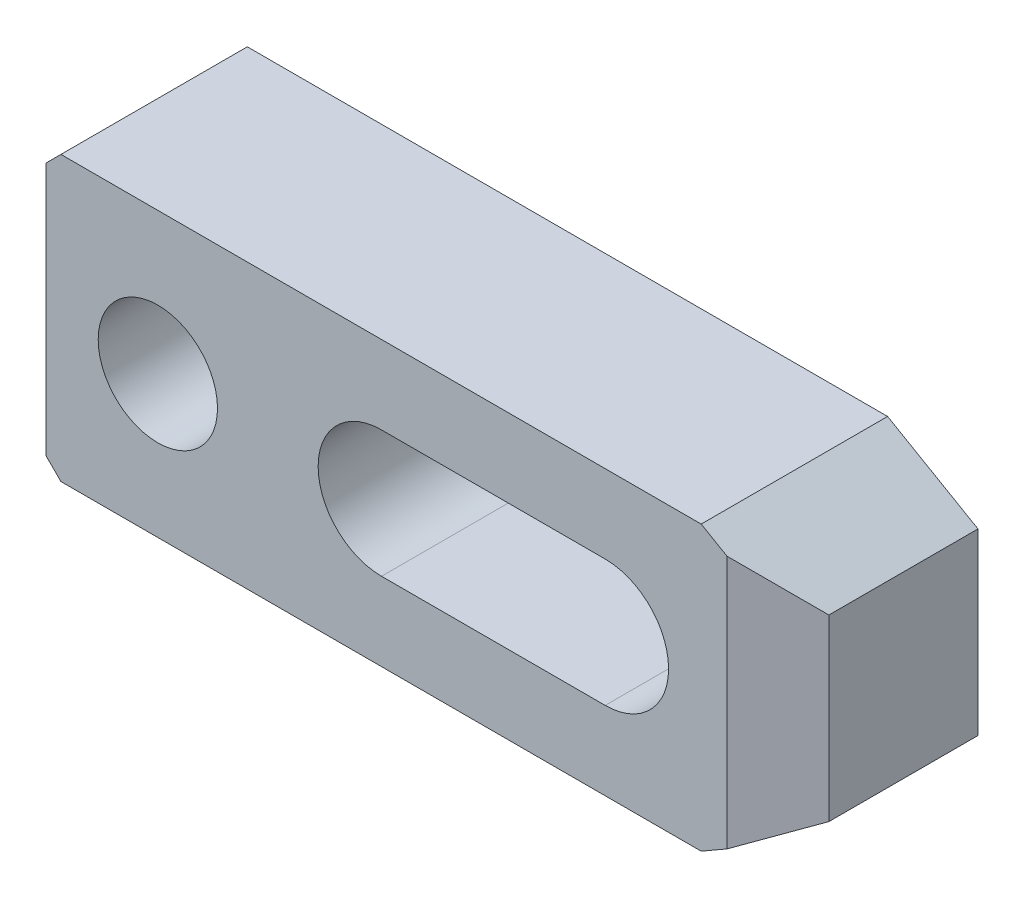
ISO-10303-21;
HEADER;
FILE_DESCRIPTION(('STEP AP214'),'2;1');
FILE_NAME('part.step','',(''),(''),'','','');
FILE_SCHEMA(('AUTOMOTIVE_DESIGN { 1 0 10303 214 1 1 1 1 }'));
ENDSEC;
DATA;
#1=APPLICATION_CONTEXT('core data for automotive mechanical design processes');
#2=APPLICATION_PROTOCOL_DEFINITION('international standard','automotive_design',2000,#1);
#3=PRODUCT_CONTEXT('',#1,'mechanical');
#4=PRODUCT('Part','Part','',(#3));
#5=PRODUCT_RELATED_PRODUCT_CATEGORY('part','',(#4));
#6=PRODUCT_DEFINITION_FORMATION('','',#4);
#7=PRODUCT_DEFINITION_CONTEXT('part definition',#1,'design');
#8=PRODUCT_DEFINITION('design','',#6,#7);
#9=PRODUCT_DEFINITION_SHAPE('','',#8);
#10=(LENGTH_UNIT() NAMED_UNIT(*) SI_UNIT(.MILLI.,.METRE.));
#11=(NAMED_UNIT(*) PLANE_ANGLE_UNIT() SI_UNIT($,.RADIAN.));
#12=(NAMED_UNIT(*) SI_UNIT($,.STERADIAN.) SOLID_ANGLE_UNIT());
#13=UNCERTAINTY_MEASURE_WITH_UNIT(LENGTH_MEASURE(1.E-05),#10,'distance_accuracy_value','');
#14=(GEOMETRIC_REPRESENTATION_CONTEXT(3) GLOBAL_UNCERTAINTY_ASSIGNED_CONTEXT((#13)) GLOBAL_UNIT_ASSIGNED_CONTEXT((#10,
#11,#12)) REPRESENTATION_CONTEXT('',''));
#15=CARTESIAN_POINT('',(0.,0.,0.));
#16=DIRECTION('',(0.,0.,1.));
#17=DIRECTION('',(1.,0.,0.));
#18=AXIS2_PLACEMENT_3D('',#15,#16,#17);
#19=CARTESIAN_POINT('',(-41.5673326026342,50.4326673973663,0.));
#20=DIRECTION('',(0.,0.,1.));
#21=DIRECTION('',(-1.,0.,0.));
#22=AXIS2_PLACEMENT_3D('',#19,#20,#21);
#23=PLANE('',#22);
#24=DIRECTION('',(0.,1.,0.));
#25=VECTOR('',#24,1.);
#26=CARTESIAN_POINT('',(-75.,-17.0000000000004,0.));
#27=LINE('',#26,#25);
#28=CARTESIAN_POINT('',(-75.,-17.0000000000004,0.));
#29=VERTEX_POINT('',#28);
#30=CARTESIAN_POINT('',(-75.,-8.50000000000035,0.));
#31=VERTEX_POINT('',#30);
#32=EDGE_CURVE('E147',#29,#31,#27,.T.);
#33=ORIENTED_EDGE('',*,*,#32,.T.);
#34=DIRECTION('',(-1.,0.,0.));
#35=VECTOR('',#34,1.);
#36=CARTESIAN_POINT('',(0.,-8.49999999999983,0.));
#37=LINE('',#36,#35);
#38=CARTESIAN_POINT('',(0.,-8.49999999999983,0.));
#39=VERTEX_POINT('',#38);
#40=EDGE_CURVE('E237',#39,#31,#37,.T.);
#41=ORIENTED_EDGE('',*,*,#40,.F.);
#42=CARTESIAN_POINT('',(0.,1.74574168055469E-13,0.));
#43=DIRECTION('',(0.,0.,1.));
#44=DIRECTION('',(-1.,0.,0.));
#45=AXIS2_PLACEMENT_3D('',#42,#43,#44);
#46=CIRCLE('',#45,8.5);
#47=CARTESIAN_POINT('',(0.,8.50000000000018,0.));
#48=VERTEX_POINT('',#47);
#49=EDGE_CURVE('E128',#39,#48,#46,.T.);
#50=ORIENTED_EDGE('',*,*,#49,.T.);
#51=DIRECTION('',(1.,0.,0.));
#52=VECTOR('',#51,1.);
#53=CARTESIAN_POINT('',(-30.,8.5,0.));
#54=LINE('',#53,#52);
#55=CARTESIAN_POINT('',(-75.,8.49999999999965,0.));
#56=VERTEX_POINT('',#55);
#57=EDGE_CURVE('E119',#56,#48,#54,.T.);
#58=ORIENTED_EDGE('',*,*,#57,.F.);
#59=CARTESIAN_POINT('',(-75.,16.9999999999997,0.));
#60=VERTEX_POINT('',#59);
#61=EDGE_CURVE('E124',#56,#60,#27,.T.);
#62=ORIENTED_EDGE('',*,*,#61,.T.);
#63=DIRECTION('',(-0.70710678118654,-0.707106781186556,0.));
#64=VECTOR('',#63,1.);
#65=CARTESIAN_POINT('',(-73.,18.9999999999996,0.));
#66=LINE('',#65,#64);
#67=CARTESIAN_POINT('',(-73.,18.9999999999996,0.));
#68=VERTEX_POINT('',#67);
#69=EDGE_CURVE('E148',#68,#60,#66,.T.);
#70=ORIENTED_EDGE('',*,*,#69,.F.);
#71=DIRECTION('',(-1.,0.,0.));
#72=VECTOR('',#71,1.);
#73=CARTESIAN_POINT('',(12.8756443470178,19.0000000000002,0.));
#74=LINE('',#73,#72);
#75=CARTESIAN_POINT('',(12.8756443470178,19.0000000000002,0.));
#76=VERTEX_POINT('',#75);
#77=EDGE_CURVE('E151',#76,#68,#74,.T.);
#78=ORIENTED_EDGE('',*,*,#77,.F.);
#79=DIRECTION('',(-0.866025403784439,0.499999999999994,0.));
#80=VECTOR('',#79,1.);
#81=CARTESIAN_POINT('',(25.,12.0000000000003,0.));
#82=LINE('',#81,#80);
#83=CARTESIAN_POINT('',(25.,12.0000000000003,0.));
#84=VERTEX_POINT('',#83);
#85=EDGE_CURVE('E158',#84,#76,#82,.T.);
#86=ORIENTED_EDGE('',*,*,#85,.F.);
#87=DIRECTION('',(0.,-1.,0.));
#88=VECTOR('',#87,1.);
#89=CARTESIAN_POINT('',(25.,12.0000000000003,0.));
#90=LINE('',#89,#88);
#91=CARTESIAN_POINT('',(25.,-11.9999999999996,0.));
#92=VERTEX_POINT('',#91);
#93=EDGE_CURVE('E181',#84,#92,#90,.T.);
#94=ORIENTED_EDGE('',*,*,#93,.T.);
#95=DIRECTION('',(-0.866025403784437,-0.500000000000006,0.));
#96=VECTOR('',#95,1.);
#97=CARTESIAN_POINT('',(25.,-11.9999999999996,0.));
#98=LINE('',#97,#96);
#99=CARTESIAN_POINT('',(12.8756443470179,-18.9999999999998,0.));
#100=VERTEX_POINT('',#99);
#101=EDGE_CURVE('E208',#92,#100,#98,.T.);
#102=ORIENTED_EDGE('',*,*,#101,.T.);
#103=DIRECTION('',(-1.,0.,0.));
#104=VECTOR('',#103,1.);
#105=CARTESIAN_POINT('',(12.8756443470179,-18.9999999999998,0.));
#106=LINE('',#105,#104);
#107=CARTESIAN_POINT('',(-73.,-19.0000000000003,0.));
#108=VERTEX_POINT('',#107);
#109=EDGE_CURVE('E210',#100,#108,#106,.T.);
#110=ORIENTED_EDGE('',*,*,#109,.T.);
#111=DIRECTION('',(-0.707106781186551,0.707106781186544,0.));
#112=VECTOR('',#111,1.);
#113=CARTESIAN_POINT('',(-73.,-19.0000000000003,0.));
#114=LINE('',#113,#112);
#115=EDGE_CURVE('E150',#108,#29,#114,.T.);
#116=ORIENTED_EDGE('',*,*,#115,.T.);
#117=EDGE_LOOP('',(#33,#41,#50,#58,#62,#70,#78,#86,#94,#102,#110,#116));
#118=FACE_BOUND('',#117,.T.);
#119=ADVANCED_FACE('F14',(#118),#23,.F.);
#120=CARTESIAN_POINT('',(-75.,-17.0000000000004,25.));
#121=DIRECTION('',(-1.,0.,0.));
#122=DIRECTION('',(0.,0.,-1.));
#123=AXIS2_PLACEMENT_3D('',#120,#121,#122);
#124=PLANE('',#123);
#125=DIRECTION('',(0.,-1.,0.));
#126=VECTOR('',#125,1.);
#127=CARTESIAN_POINT('',(-75.,-17.0000000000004,5.));
#128=LINE('',#127,#126);
#129=CARTESIAN_POINT('',(-75.,8.49999999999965,5.));
#130=VERTEX_POINT('',#129);
#131=CARTESIAN_POINT('',(-75.,-8.50000000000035,5.));
#132=VERTEX_POINT('',#131);
#133=EDGE_CURVE('E141',#130,#132,#128,.T.);
#134=ORIENTED_EDGE('',*,*,#133,.T.);
#135=DIRECTION('',(0.,0.,-1.));
#136=VECTOR('',#135,1.);
#137=CARTESIAN_POINT('',(-75.,-8.50000000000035,25.));
#138=LINE('',#137,#136);
#139=EDGE_CURVE('E140',#132,#31,#138,.T.);
#140=ORIENTED_EDGE('',*,*,#139,.T.);
#141=ORIENTED_EDGE('',*,*,#32,.F.);
#142=DIRECTION('',(0.,0.,-1.));
#143=VECTOR('',#142,1.);
#144=CARTESIAN_POINT('',(-75.,-17.0000000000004,25.));
#145=LINE('',#144,#143);
#146=CARTESIAN_POINT('',(-75.,-17.0000000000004,25.));
#147=VERTEX_POINT('',#146);
#148=EDGE_CURVE('E189',#147,#29,#145,.T.);
#149=ORIENTED_EDGE('',*,*,#148,.F.);
#150=DIRECTION('',(0.,1.,0.));
#151=VECTOR('',#150,1.);
#152=CARTESIAN_POINT('',(-75.,-17.0000000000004,25.));
#153=LINE('',#152,#151);
#154=CARTESIAN_POINT('',(-75.,16.9999999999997,25.));
#155=VERTEX_POINT('',#154);
#156=EDGE_CURVE('E171',#147,#155,#153,.T.);
#157=ORIENTED_EDGE('',*,*,#156,.T.);
#158=DIRECTION('',(0.,0.,-1.));
#159=VECTOR('',#158,1.);
#160=CARTESIAN_POINT('',(-75.,16.9999999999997,25.));
#161=LINE('',#160,#159);
#162=EDGE_CURVE('E145',#155,#60,#161,.T.);
#163=ORIENTED_EDGE('',*,*,#162,.T.);
#164=ORIENTED_EDGE('',*,*,#61,.F.);
#165=DIRECTION('',(0.,0.,-1.));
#166=VECTOR('',#165,1.);
#167=CARTESIAN_POINT('',(-75.,8.49999999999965,25.));
#168=LINE('',#167,#166);
#169=EDGE_CURVE('E135',#130,#56,#168,.T.);
#170=ORIENTED_EDGE('',*,*,#169,.F.);
#171=EDGE_LOOP('',(#134,#140,#141,#149,#157,#163,#164,#170));
#172=FACE_BOUND('',#171,.T.);
#173=ADVANCED_FACE('F143',(#172),#124,.T.);
#174=CARTESIAN_POINT('',(-60.,-2.35832403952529E-13,25.));
#175=DIRECTION('',(0.,0.,-1.));
#176=DIRECTION('',(1.,0.,0.));
#177=AXIS2_PLACEMENT_3D('',#174,#175,#176);
#178=CYLINDRICAL_SURFACE('',#177,8.);
#179=CARTESIAN_POINT('',(-60.,-2.35832403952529E-13,25.));
#180=DIRECTION('',(0.,0.,1.));
#181=DIRECTION('',(-1.,0.,0.));
#182=AXIS2_PLACEMENT_3D('',#179,#180,#181);
#183=CIRCLE('',#182,8.);
#184=CARTESIAN_POINT('',(-68.,-2.9169613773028E-13,25.));
#185=VERTEX_POINT('',#184);
#186=EDGE_CURVE('E161',#185,#185,#183,.T.);
#187=ORIENTED_EDGE('',*,*,#186,.T.);
#188=EDGE_LOOP('',(#187));
#189=FACE_BOUND('',#188,.T.);
#190=CARTESIAN_POINT('',(-60.,-2.35832403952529E-13,5.));
#191=DIRECTION('',(0.,0.,-1.));
#192=DIRECTION('',(1.,0.,0.));
#193=AXIS2_PLACEMENT_3D('',#190,#191,#192);
#194=CIRCLE('',#193,8.);
#195=CARTESIAN_POINT('',(-52.,-1.79968670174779E-13,5.));
#196=VERTEX_POINT('',#195);
#197=EDGE_CURVE('E400',#196,#196,#194,.T.);
#198=ORIENTED_EDGE('',*,*,#197,.T.);
#199=EDGE_LOOP('',(#198));
#200=FACE_BOUND('',#199,.T.);
#201=ADVANCED_FACE('F262',(#189,#200),#178,.F.);
#202=CARTESIAN_POINT('',(-30.,0.,25.));
#203=DIRECTION('',(0.,0.,-1.));
#204=DIRECTION('',(1.,0.,0.));
#205=AXIS2_PLACEMENT_3D('',#202,#203,#204);
#206=CYLINDRICAL_SURFACE('',#205,8.5);
#207=DIRECTION('',(0.,0.,-1.));
#208=VECTOR('',#207,1.);
#209=CARTESIAN_POINT('',(-30.,-8.5,25.));
#210=LINE('',#209,#208);
#211=CARTESIAN_POINT('',(-30.,-8.5,25.));
#212=VERTEX_POINT('',#211);
#213=CARTESIAN_POINT('',(-30.,-8.5,5.));
#214=VERTEX_POINT('',#213);
#215=EDGE_CURVE('E256',#212,#214,#210,.T.);
#216=ORIENTED_EDGE('',*,*,#215,.T.);
#217=CARTESIAN_POINT('',(-30.,0.,5.));
#218=DIRECTION('',(0.,0.,-1.));
#219=DIRECTION('',(1.,0.,0.));
#220=AXIS2_PLACEMENT_3D('',#217,#218,#219);
#221=CIRCLE('',#220,8.5);
#222=CARTESIAN_POINT('',(-30.,8.5,5.));
#223=VERTEX_POINT('',#222);
#224=EDGE_CURVE('E278',#214,#223,#221,.T.);
#225=ORIENTED_EDGE('',*,*,#224,.T.);
#226=DIRECTION('',(0.,0.,-1.));
#227=VECTOR('',#226,1.);
#228=CARTESIAN_POINT('',(-30.,8.5,25.));
#229=LINE('',#228,#227);
#230=CARTESIAN_POINT('',(-30.,8.5,25.));
#231=VERTEX_POINT('',#230);
#232=EDGE_CURVE('E244',#231,#223,#229,.T.);
#233=ORIENTED_EDGE('',*,*,#232,.F.);
#234=CARTESIAN_POINT('',(-30.,0.,25.));
#235=DIRECTION('',(0.,0.,1.));
#236=DIRECTION('',(-1.,0.,0.));
#237=AXIS2_PLACEMENT_3D('',#234,#235,#236);
#238=CIRCLE('',#237,8.5);
#239=EDGE_CURVE('E132',#231,#212,#238,.T.);
#240=ORIENTED_EDGE('',*,*,#239,.T.);
#241=EDGE_LOOP('',(#216,#225,#233,#240));
#242=FACE_BOUND('',#241,.T.);
#243=ADVANCED_FACE('F269',(#242),#206,.F.);
#244=CARTESIAN_POINT('',(-41.5673326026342,50.4326673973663,25.));
#245=DIRECTION('',(0.,0.,1.));
#246=DIRECTION('',(-1.,0.,0.));
#247=AXIS2_PLACEMENT_3D('',#244,#245,#246);
#248=PLANE('',#247);
#249=DIRECTION('',(0.,-1.,0.));
#250=VECTOR('',#249,1.);
#251=CARTESIAN_POINT('',(16.3397459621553,50.4326673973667,25.));
#252=LINE('',#251,#250);
#253=CARTESIAN_POINT('',(16.3397459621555,17.0000000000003,25.));
#254=VERTEX_POINT('',#253);
#255=CARTESIAN_POINT('',(16.3397459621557,-16.9999999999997,25.));
#256=VERTEX_POINT('',#255);
#257=EDGE_CURVE('E233',#254,#256,#252,.T.);
#258=ORIENTED_EDGE('',*,*,#257,.F.);
#259=DIRECTION('',(-0.866025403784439,0.499999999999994,0.));
#260=VECTOR('',#259,1.);
#261=CARTESIAN_POINT('',(25.,12.0000000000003,25.));
#262=LINE('',#261,#260);
#263=CARTESIAN_POINT('',(12.8756443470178,19.0000000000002,25.));
#264=VERTEX_POINT('',#263);
#265=EDGE_CURVE('E179',#254,#264,#262,.T.);
#266=ORIENTED_EDGE('',*,*,#265,.T.);
#267=DIRECTION('',(-1.,0.,0.));
#268=VECTOR('',#267,1.);
#269=CARTESIAN_POINT('',(12.8756443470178,19.0000000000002,25.));
#270=LINE('',#269,#268);
#271=CARTESIAN_POINT('',(-73.,18.9999999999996,25.));
#272=VERTEX_POINT('',#271);
#273=EDGE_CURVE('E176',#264,#272,#270,.T.);
#274=ORIENTED_EDGE('',*,*,#273,.T.);
#275=DIRECTION('',(-0.70710678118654,-0.707106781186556,0.));
#276=VECTOR('',#275,1.);
#277=CARTESIAN_POINT('',(-73.,18.9999999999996,25.));
#278=LINE('',#277,#276);
#279=EDGE_CURVE('E173',#272,#155,#278,.T.);
#280=ORIENTED_EDGE('',*,*,#279,.T.);
#281=ORIENTED_EDGE('',*,*,#156,.F.);
#282=DIRECTION('',(-0.707106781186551,0.707106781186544,0.));
#283=VECTOR('',#282,1.);
#284=CARTESIAN_POINT('',(-73.,-19.0000000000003,25.));
#285=LINE('',#284,#283);
#286=CARTESIAN_POINT('',(-73.,-19.0000000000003,25.));
#287=VERTEX_POINT('',#286);
#288=EDGE_CURVE('E168',#287,#147,#285,.T.);
#289=ORIENTED_EDGE('',*,*,#288,.F.);
#290=DIRECTION('',(-1.,0.,0.));
#291=VECTOR('',#290,1.);
#292=CARTESIAN_POINT('',(12.8756443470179,-18.9999999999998,25.));
#293=LINE('',#292,#291);
#294=CARTESIAN_POINT('',(12.8756443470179,-18.9999999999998,25.));
#295=VERTEX_POINT('',#294);
#296=EDGE_CURVE('E165',#295,#287,#293,.T.);
#297=ORIENTED_EDGE('',*,*,#296,.F.);
#298=DIRECTION('',(-0.866025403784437,-0.500000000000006,0.));
#299=VECTOR('',#298,1.);
#300=CARTESIAN_POINT('',(25.,-11.9999999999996,25.));
#301=LINE('',#300,#299);
#302=EDGE_CURVE('E162',#256,#295,#301,.T.);
#303=ORIENTED_EDGE('',*,*,#302,.F.);
#304=EDGE_LOOP('',(#258,#266,#274,#280,#281,#289,#297,#303));
#305=FACE_BOUND('',#304,.T.);
#306=ORIENTED_EDGE('',*,*,#186,.F.);
#307=EDGE_LOOP('',(#306));
#308=FACE_BOUND('',#307,.T.);
#309=DIRECTION('',(-1.,0.,0.));
#310=VECTOR('',#309,1.);
#311=CARTESIAN_POINT('',(0.,-8.49999999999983,25.));
#312=LINE('',#311,#310);
#313=CARTESIAN_POINT('',(0.,-8.49999999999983,25.));
#314=VERTEX_POINT('',#313);
#315=EDGE_CURVE('E247',#314,#212,#312,.T.);
#316=ORIENTED_EDGE('',*,*,#315,.T.);
#317=ORIENTED_EDGE('',*,*,#239,.F.);
#318=DIRECTION('',(1.,0.,0.));
#319=VECTOR('',#318,1.);
#320=CARTESIAN_POINT('',(-30.,8.5,25.));
#321=LINE('',#320,#319);
#322=CARTESIAN_POINT('',(0.,8.50000000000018,25.));
#323=VERTEX_POINT('',#322);
#324=EDGE_CURVE('E241',#231,#323,#321,.T.);
#325=ORIENTED_EDGE('',*,*,#324,.T.);
#326=CARTESIAN_POINT('',(0.,1.74574168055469E-13,25.));
#327=DIRECTION('',(0.,0.,1.));
#328=DIRECTION('',(-1.,0.,0.));
#329=AXIS2_PLACEMENT_3D('',#326,#327,#328);
#330=CIRCLE('',#329,8.5);
#331=EDGE_CURVE('E245',#314,#323,#330,.T.);
#332=ORIENTED_EDGE('',*,*,#331,.F.);
#333=EDGE_LOOP('',(#316,#317,#325,#332));
#334=FACE_BOUND('',#333,.T.);
#335=ADVANCED_FACE('F265',(#305,#308,#334),#248,.T.);
#336=CARTESIAN_POINT('',(25.,12.0000000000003,25.));
#337=DIRECTION('',(-0.499999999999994,-0.866025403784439,0.));
#338=DIRECTION('',(0.86602540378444,-0.499999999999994,0.));
#339=AXIS2_PLACEMENT_3D('',#336,#337,#338);
#340=PLANE('',#339);
#341=ORIENTED_EDGE('',*,*,#265,.F.);
#342=DIRECTION('',(0.774596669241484,-0.447213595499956,-0.447213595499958));
#343=VECTOR('',#342,1.);
#344=CARTESIAN_POINT('',(23.2679491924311,13.0000000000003,21.));
#345=LINE('',#344,#343);
#346=CARTESIAN_POINT('',(25.,12.0000000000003,20.));
#347=VERTEX_POINT('',#346);
#348=EDGE_CURVE('E235',#254,#347,#345,.T.);
#349=ORIENTED_EDGE('',*,*,#348,.T.);
#350=DIRECTION('',(0.,0.,-1.));
#351=VECTOR('',#350,1.);
#352=CARTESIAN_POINT('',(25.,12.0000000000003,25.));
#353=LINE('',#352,#351);
#354=EDGE_CURVE('E164',#347,#84,#353,.T.);
#355=ORIENTED_EDGE('',*,*,#354,.T.);
#356=ORIENTED_EDGE('',*,*,#85,.T.);
#357=DIRECTION('',(0.,0.,-1.));
#358=VECTOR('',#357,1.);
#359=CARTESIAN_POINT('',(12.8756443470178,19.0000000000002,25.));
#360=LINE('',#359,#358);
#361=EDGE_CURVE('E9',#264,#76,#360,.T.);
#362=ORIENTED_EDGE('',*,*,#361,.F.);
#363=EDGE_LOOP('',(#341,#349,#355,#356,#362));
#364=FACE_BOUND('',#363,.T.);
#365=ADVANCED_FACE('F268',(#364),#340,.F.);
#366=CARTESIAN_POINT('',(12.8756443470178,19.0000000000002,25.));
#367=DIRECTION('',(0.,-1.,0.));
#368=DIRECTION('',(0.,0.,1.));
#369=AXIS2_PLACEMENT_3D('',#366,#367,#368);
#370=PLANE('',#369);
#371=DIRECTION('',(0.,0.,-1.));
#372=VECTOR('',#371,1.);
#373=CARTESIAN_POINT('',(-73.,18.9999999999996,25.));
#374=LINE('',#373,#372);
#375=EDGE_CURVE('E22',#272,#68,#374,.T.);
#376=ORIENTED_EDGE('',*,*,#375,.F.);
#377=ORIENTED_EDGE('',*,*,#273,.F.);
#378=ORIENTED_EDGE('',*,*,#361,.T.);
#379=ORIENTED_EDGE('',*,*,#77,.T.);
#380=EDGE_LOOP('',(#376,#377,#378,#379));
#381=FACE_BOUND('',#380,.T.);
#382=ADVANCED_FACE('F16',(#381),#370,.F.);
#383=CARTESIAN_POINT('',(-73.,18.9999999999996,25.));
#384=DIRECTION('',(0.707106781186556,-0.70710678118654,0.));
#385=DIRECTION('',(0.70710678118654,0.707106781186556,0.));
#386=AXIS2_PLACEMENT_3D('',#383,#384,#385);
#387=PLANE('',#386);
#388=ORIENTED_EDGE('',*,*,#162,.F.);
#389=ORIENTED_EDGE('',*,*,#279,.F.);
#390=ORIENTED_EDGE('',*,*,#375,.T.);
#391=ORIENTED_EDGE('',*,*,#69,.T.);
#392=EDGE_LOOP('',(#388,#389,#390,#391));
#393=FACE_BOUND('',#392,.T.);
#394=ADVANCED_FACE('F193',(#393),#387,.F.);
#395=CARTESIAN_POINT('',(-73.,-19.0000000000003,25.));
#396=DIRECTION('',(-0.707106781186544,-0.707106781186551,0.));
#397=DIRECTION('',(0.707106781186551,-0.707106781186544,0.));
#398=AXIS2_PLACEMENT_3D('',#395,#396,#397);
#399=PLANE('',#398);
#400=DIRECTION('',(0.,0.,-1.));
#401=VECTOR('',#400,1.);
#402=CARTESIAN_POINT('',(-73.,-19.0000000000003,25.));
#403=LINE('',#402,#401);
#404=EDGE_CURVE('E187',#287,#108,#403,.T.);
#405=ORIENTED_EDGE('',*,*,#404,.F.);
#406=ORIENTED_EDGE('',*,*,#288,.T.);
#407=ORIENTED_EDGE('',*,*,#148,.T.);
#408=ORIENTED_EDGE('',*,*,#115,.F.);
#409=EDGE_LOOP('',(#405,#406,#407,#408));
#410=FACE_BOUND('',#409,.T.);
#411=ADVANCED_FACE('F220',(#410),#399,.T.);
#412=CARTESIAN_POINT('',(12.8756443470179,-18.9999999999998,25.));
#413=DIRECTION('',(0.,-1.,0.));
#414=DIRECTION('',(0.,0.,1.));
#415=AXIS2_PLACEMENT_3D('',#412,#413,#414);
#416=PLANE('',#415);
#417=DIRECTION('',(0.,0.,-1.));
#418=VECTOR('',#417,1.);
#419=CARTESIAN_POINT('',(12.8756443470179,-18.9999999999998,25.));
#420=LINE('',#419,#418);
#421=EDGE_CURVE('E185',#295,#100,#420,.T.);
#422=ORIENTED_EDGE('',*,*,#421,.F.);
#423=ORIENTED_EDGE('',*,*,#296,.T.);
#424=ORIENTED_EDGE('',*,*,#404,.T.);
#425=ORIENTED_EDGE('',*,*,#109,.F.);
#426=EDGE_LOOP('',(#422,#423,#424,#425));
#427=FACE_BOUND('',#426,.T.);
#428=ADVANCED_FACE('F308',(#427),#416,.T.);
#429=CARTESIAN_POINT('',(25.,-11.9999999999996,25.));
#430=DIRECTION('',(0.500000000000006,-0.866025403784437,0.));
#431=DIRECTION('',(0.866025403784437,0.500000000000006,0.));
#432=AXIS2_PLACEMENT_3D('',#429,#430,#431);
#433=PLANE('',#432);
#434=DIRECTION('',(0.774596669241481,0.447213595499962,-0.44721359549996));
#435=VECTOR('',#434,1.);
#436=CARTESIAN_POINT('',(23.2679491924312,-12.9999999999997,21.));
#437=LINE('',#436,#435);
#438=CARTESIAN_POINT('',(25.,-11.9999999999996,20.));
#439=VERTEX_POINT('',#438);
#440=EDGE_CURVE('E37',#256,#439,#437,.T.);
#441=ORIENTED_EDGE('',*,*,#440,.F.);
#442=ORIENTED_EDGE('',*,*,#302,.T.);
#443=ORIENTED_EDGE('',*,*,#421,.T.);
#444=ORIENTED_EDGE('',*,*,#101,.F.);
#445=DIRECTION('',(0.,0.,-1.));
#446=VECTOR('',#445,1.);
#447=CARTESIAN_POINT('',(25.,-11.9999999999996,25.));
#448=LINE('',#447,#446);
#449=EDGE_CURVE('E183',#439,#92,#448,.T.);
#450=ORIENTED_EDGE('',*,*,#449,.F.);
#451=EDGE_LOOP('',(#441,#442,#443,#444,#450));
#452=FACE_BOUND('',#451,.T.);
#453=ADVANCED_FACE('F305',(#452),#433,.T.);
#454=CARTESIAN_POINT('',(25.,12.0000000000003,25.));
#455=DIRECTION('',(1.,0.,0.));
#456=DIRECTION('',(0.,0.,1.));
#457=AXIS2_PLACEMENT_3D('',#454,#455,#456);
#458=PLANE('',#457);
#459=DIRECTION('',(0.,-1.,0.));
#460=VECTOR('',#459,1.);
#461=CARTESIAN_POINT('',(25.,20.0000000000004,20.));
#462=LINE('',#461,#460);
#463=EDGE_CURVE('E227',#347,#439,#462,.T.);
#464=ORIENTED_EDGE('',*,*,#463,.T.);
#465=ORIENTED_EDGE('',*,*,#449,.T.);
#466=ORIENTED_EDGE('',*,*,#93,.F.);
#467=ORIENTED_EDGE('',*,*,#354,.F.);
#468=EDGE_LOOP('',(#464,#465,#466,#467));
#469=FACE_BOUND('',#468,.T.);
#470=ADVANCED_FACE('F205',(#469),#458,.T.);
#471=CARTESIAN_POINT('',(0.,-8.49999999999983,25.));
#472=DIRECTION('',(0.,-1.,0.));
#473=DIRECTION('',(0.,0.,1.));
#474=AXIS2_PLACEMENT_3D('',#471,#472,#473);
#475=PLANE('',#474);
#476=ORIENTED_EDGE('',*,*,#40,.T.);
#477=ORIENTED_EDGE('',*,*,#139,.F.);
#478=DIRECTION('',(1.,0.,0.));
#479=VECTOR('',#478,1.);
#480=CARTESIAN_POINT('',(-85.,-8.50000000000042,5.));
#481=LINE('',#480,#479);
#482=EDGE_CURVE('E276',#132,#214,#481,.T.);
#483=ORIENTED_EDGE('',*,*,#482,.T.);
#484=ORIENTED_EDGE('',*,*,#215,.F.);
#485=ORIENTED_EDGE('',*,*,#315,.F.);
#486=DIRECTION('',(0.,0.,-1.));
#487=VECTOR('',#486,1.);
#488=CARTESIAN_POINT('',(0.,-8.49999999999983,25.));
#489=LINE('',#488,#487);
#490=EDGE_CURVE('E255',#314,#39,#489,.T.);
#491=ORIENTED_EDGE('',*,*,#490,.T.);
#492=EDGE_LOOP('',(#476,#477,#483,#484,#485,#491));
#493=FACE_BOUND('',#492,.T.);
#494=ADVANCED_FACE('F275',(#493),#475,.F.);
#495=CARTESIAN_POINT('',(0.,1.74574168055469E-13,25.));
#496=DIRECTION('',(0.,0.,-1.));
#497=DIRECTION('',(1.,0.,0.));
#498=AXIS2_PLACEMENT_3D('',#495,#496,#497);
#499=CYLINDRICAL_SURFACE('',#498,8.5);
#500=DIRECTION('',(0.,0.,-1.));
#501=VECTOR('',#500,1.);
#502=CARTESIAN_POINT('',(0.,8.50000000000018,25.));
#503=LINE('',#502,#501);
#504=EDGE_CURVE('E253',#323,#48,#503,.T.);
#505=ORIENTED_EDGE('',*,*,#504,.T.);
#506=ORIENTED_EDGE('',*,*,#49,.F.);
#507=ORIENTED_EDGE('',*,*,#490,.F.);
#508=ORIENTED_EDGE('',*,*,#331,.T.);
#509=EDGE_LOOP('',(#505,#506,#507,#508));
#510=FACE_BOUND('',#509,.T.);
#511=ADVANCED_FACE('F280',(#510),#499,.F.);
#512=CARTESIAN_POINT('',(-30.,8.5,25.));
#513=DIRECTION('',(0.,1.,0.));
#514=DIRECTION('',(-1.,0.,0.));
#515=AXIS2_PLACEMENT_3D('',#512,#513,#514);
#516=PLANE('',#515);
#517=ORIENTED_EDGE('',*,*,#57,.T.);
#518=ORIENTED_EDGE('',*,*,#504,.F.);
#519=ORIENTED_EDGE('',*,*,#324,.F.);
#520=ORIENTED_EDGE('',*,*,#232,.T.);
#521=DIRECTION('',(1.,0.,0.));
#522=VECTOR('',#521,1.);
#523=CARTESIAN_POINT('',(-85.,8.49999999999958,5.));
#524=LINE('',#523,#522);
#525=EDGE_CURVE('E29',#130,#223,#524,.T.);
#526=ORIENTED_EDGE('',*,*,#525,.F.);
#527=ORIENTED_EDGE('',*,*,#169,.T.);
#528=EDGE_LOOP('',(#517,#518,#519,#520,#526,#527));
#529=FACE_BOUND('',#528,.T.);
#530=ADVANCED_FACE('F136',(#529),#516,.F.);
#531=CARTESIAN_POINT('',(12.8756443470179,20.0000000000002,27.));
#532=DIRECTION('',(-0.5,0.,-0.866025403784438));
#533=DIRECTION('',(0.866025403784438,0.,-0.5));
#534=AXIS2_PLACEMENT_3D('',#531,#532,#533);
#535=PLANE('',#534);
#536=ORIENTED_EDGE('',*,*,#257,.T.);
#537=ORIENTED_EDGE('',*,*,#440,.T.);
#538=ORIENTED_EDGE('',*,*,#463,.F.);
#539=ORIENTED_EDGE('',*,*,#348,.F.);
#540=EDGE_LOOP('',(#536,#537,#538,#539));
#541=FACE_BOUND('',#540,.T.);
#542=ADVANCED_FACE('F289',(#541),#535,.F.);
#543=CARTESIAN_POINT('',(-85.,-8.50000000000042,5.));
#544=DIRECTION('',(0.,0.,-1.));
#545=DIRECTION('',(1.,0.,0.));
#546=AXIS2_PLACEMENT_3D('',#543,#544,#545);
#547=PLANE('',#546);
#548=ORIENTED_EDGE('',*,*,#197,.F.);
#549=EDGE_LOOP('',(#548));
#550=FACE_BOUND('',#549,.T.);
#551=ORIENTED_EDGE('',*,*,#525,.T.);
#552=ORIENTED_EDGE('',*,*,#224,.F.);
#553=ORIENTED_EDGE('',*,*,#482,.F.);
#554=ORIENTED_EDGE('',*,*,#133,.F.);
#555=EDGE_LOOP('',(#551,#552,#553,#554));
#556=FACE_BOUND('',#555,.T.);
#557=ADVANCED_FACE('F386',(#550,#556),#547,.T.);
#558=CLOSED_SHELL('',(#119,#173,#201,#243,#335,#365,#382,#394,#411,#428,#453,#470,#494,#511,
#530,#542,#557));
#559=MANIFOLD_SOLID_BREP('B1',#558);
#560=ADVANCED_BREP_SHAPE_REPRESENTATION('',(#18,#559),#14);
#561=SHAPE_DEFINITION_REPRESENTATION(#9,#560);
ENDSEC;
END-ISO-10303-21;
